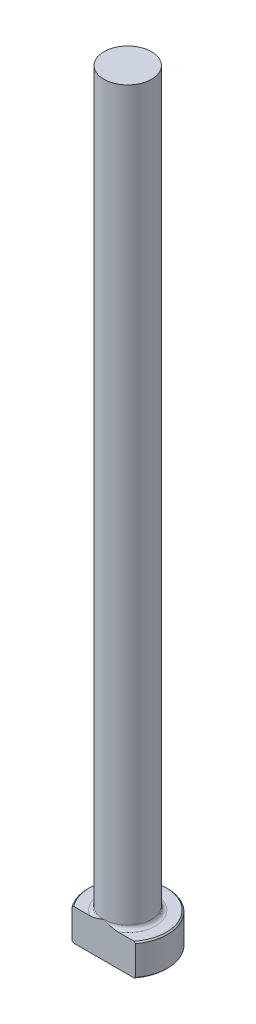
from build123d import *

# Parameters (mm, degrees)
CHAMFER1_SIZE = 0.254
FILLET1_R     = 0.762
KEY_DEPTH     = 153.812852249


with BuildPart() as part:
    # Sketch1 → Revolve1 (revolve)
    with BuildSketch(Plane.XY, mode=Mode.PRIVATE) as revolve1_sk:
        Polygon((0, 0), (-7.9375, 0), (-7.9375, 6.35), (-4.7625, 6.35), (-4.7625, 152.4), (0, 152.4), align=None)
    revolve(revolve1_sk.sketch.rotate(Axis((0, 259.958771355, 0), (0, -1, 0)), 270), axis=Axis((0, 259.958771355, 0), (0, -1, 0)))

    # Chamfer1
    chamfer1_edges = [part.edges().sort_by_distance(p)[0] for p in [
        (0, 6.35, -7.9375),
        (0, 0, -7.9375),
    ]]
    chamfer(chamfer1_edges, length=CHAMFER1_SIZE)

    # Fillet1
    fillet1_edges = [part.edges().sort_by_distance(p)[0] for p in [
        (0, 6.35, -4.7625),
    ]]
    fillet(fillet1_edges, radius=FILLET1_R)

    # Sketch2 → Key (cut, through all)
    with BuildSketch(Plane(origin=(0, 0, 0), x_dir=(1, 0, 0), z_dir=(0, 1, 0))):
        with BuildLine():
            Line((-6.35, -4.7625), (6.35, -4.7625))
            ThreePointArc((6.35, -4.7625), (0, -7.9375), (-6.35, -4.7625))
        make_face()
    extrude(amount=KEY_DEPTH, mode=Mode.SUBTRACT)


solid = part.part
